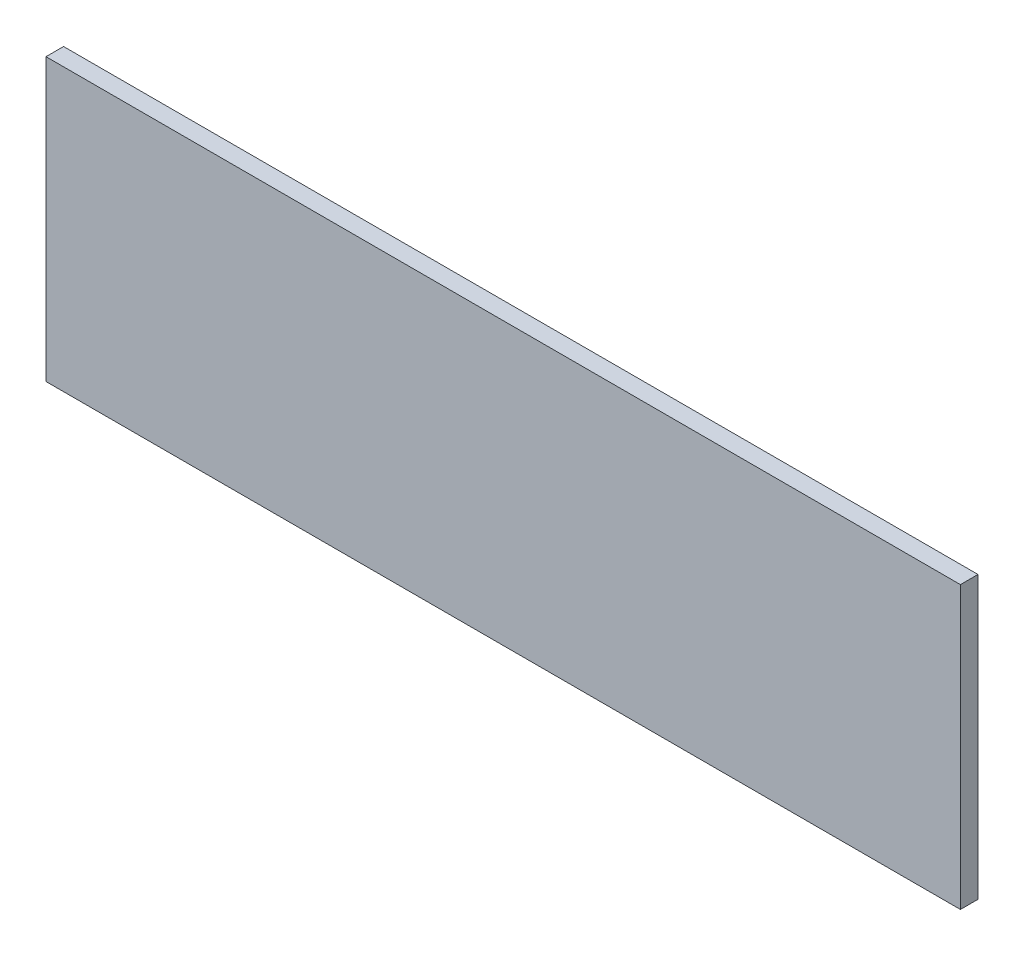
from build123d import *

# Parameters (mm, degrees)
CROQUIS1_W              = 780
CROQUIS1_H              = 240
SALIENTE_EXTRUIR1_DEPTH = 15


with BuildPart() as part:
    # Croquis1 → Saliente-Extruir1 (new body)
    with BuildSketch(Plane.XY):
        with Locations((2.867698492, 26.204792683)):
            Rectangle(CROQUIS1_W, CROQUIS1_H)
    extrude(amount=SALIENTE_EXTRUIR1_DEPTH)


solid = part.part
